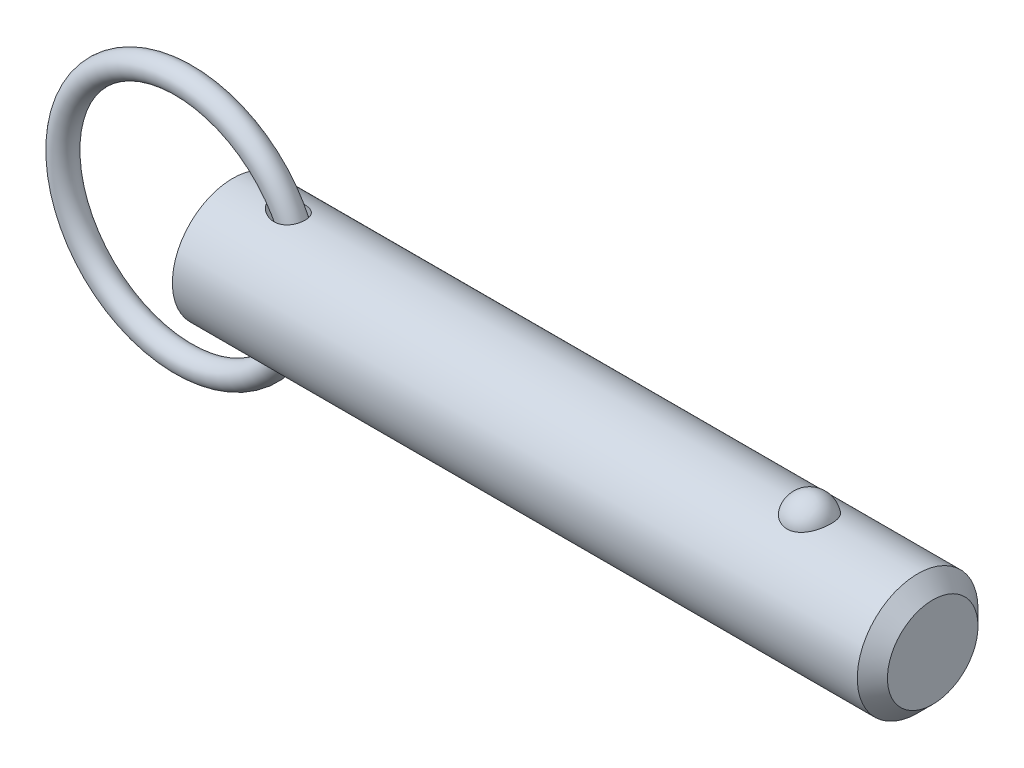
ISO-10303-21;
HEADER;
FILE_DESCRIPTION(('STEP AP214'),'2;1');
FILE_NAME('part.step','',(''),(''),'','','');
FILE_SCHEMA(('AUTOMOTIVE_DESIGN { 1 0 10303 214 1 1 1 1 }'));
ENDSEC;
DATA;
#1=APPLICATION_CONTEXT('core data for automotive mechanical design processes');
#2=APPLICATION_PROTOCOL_DEFINITION('international standard','automotive_design',2000,#1);
#3=PRODUCT_CONTEXT('',#1,'mechanical');
#4=PRODUCT('Part','Part','',(#3));
#5=PRODUCT_RELATED_PRODUCT_CATEGORY('part','',(#4));
#6=PRODUCT_DEFINITION_FORMATION('','',#4);
#7=PRODUCT_DEFINITION_CONTEXT('part definition',#1,'design');
#8=PRODUCT_DEFINITION('design','',#6,#7);
#9=PRODUCT_DEFINITION_SHAPE('','',#8);
#10=(LENGTH_UNIT() NAMED_UNIT(*) SI_UNIT(.MILLI.,.METRE.));
#11=(NAMED_UNIT(*) PLANE_ANGLE_UNIT() SI_UNIT($,.RADIAN.));
#12=(NAMED_UNIT(*) SI_UNIT($,.STERADIAN.) SOLID_ANGLE_UNIT());
#13=UNCERTAINTY_MEASURE_WITH_UNIT(LENGTH_MEASURE(1.E-05),#10,'distance_accuracy_value','');
#14=(GEOMETRIC_REPRESENTATION_CONTEXT(3) GLOBAL_UNCERTAINTY_ASSIGNED_CONTEXT((#13)) GLOBAL_UNIT_ASSIGNED_CONTEXT((#10,
#11,#12)) REPRESENTATION_CONTEXT('',''));
#15=CARTESIAN_POINT('',(0.,0.,0.));
#16=DIRECTION('',(0.,0.,1.));
#17=DIRECTION('',(1.,0.,0.));
#18=AXIS2_PLACEMENT_3D('',#15,#16,#17);
#19=CARTESIAN_POINT('',(-6.46799987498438,0.,0.));
#20=DIRECTION('',(0.,0.,1.));
#21=DIRECTION('',(1.,0.,0.));
#22=AXIS2_PLACEMENT_3D('',#19,#20,#21);
#23=TOROIDAL_SURFACE('',#22,15.875,1.588);
#24=CARTESIAN_POINT('',(10.9950001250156,0.,0.));
#25=VERTEX_POINT('',#24);
#26=VERTEX_LOOP('',#25);
#27=FACE_BOUND('',#26,.T.);
#28=ADVANCED_FACE('P0_F12',(#27),#23,.T.);
#29=CLOSED_SHELL('',(#28));
#30=MANIFOLD_SOLID_BREP('P0_B1',#29);
#31=CARTESIAN_POINT('',(0.,0.,0.));
#32=DIRECTION('',(1.,0.,0.));
#33=DIRECTION('',(0.,0.,-1.));
#34=AXIS2_PLACEMENT_3D('',#31,#32,#33);
#35=CYLINDRICAL_SURFACE('',#34,7.94);
#36=CARTESIAN_POINT('',(5.37881269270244,7.8641200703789,-1.0950869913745));
#37=CARTESIAN_POINT('',(5.49078530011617,7.84653010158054,-1.22142628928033));
#38=CARTESIAN_POINT('',(5.61742164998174,7.82766483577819,-1.33478448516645));
#39=CARTESIAN_POINT('',(5.82155225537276,7.80005811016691,-1.48501770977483));
#40=CARTESIAN_POINT('',(5.89211597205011,7.79095331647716,-1.53186949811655));
#41=CARTESIAN_POINT('',(6.03726296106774,7.77331484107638,-1.61899652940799));
#42=CARTESIAN_POINT('',(6.11184478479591,7.76478095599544,-1.65927412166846));
#43=CARTESIAN_POINT('',(6.31831542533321,7.74290334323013,-1.75933205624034));
#44=CARTESIAN_POINT('',(6.45343253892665,7.73042593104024,-1.81276183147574));
#45=CARTESIAN_POINT('',(6.73017339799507,7.70966096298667,-1.89912673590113));
#46=CARTESIAN_POINT('',(6.87179099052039,7.70136953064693,-1.93208083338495));
#47=CARTESIAN_POINT('',(7.17522096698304,7.6896684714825,-1.97820987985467));
#48=CARTESIAN_POINT('',(7.33750100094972,7.68691980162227,-1.98871513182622));
#49=CARTESIAN_POINT('',(7.5799424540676,7.68880305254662,-1.98137951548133));
#50=CARTESIAN_POINT('',(7.66059155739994,7.69043175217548,-1.97508575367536));
#51=CARTESIAN_POINT('',(7.82077465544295,7.69570110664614,-1.95445819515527));
#52=CARTESIAN_POINT('',(7.90030910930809,7.69934090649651,-1.94012781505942));
#53=CARTESIAN_POINT('',(8.09280087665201,7.71066069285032,-1.89475688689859));
#54=CARTESIAN_POINT('',(8.20465204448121,7.71942251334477,-1.85909462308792));
#55=CARTESIAN_POINT('',(8.42059371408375,7.74035594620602,-1.7699066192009));
#56=CARTESIAN_POINT('',(8.52468939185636,7.75252525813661,-1.71639292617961));
#57=CARTESIAN_POINT('',(8.72211003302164,7.77903750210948,-1.59192358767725));
#58=CARTESIAN_POINT('',(8.81539818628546,7.79338749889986,-1.52091076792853));
#59=CARTESIAN_POINT('',(8.98759177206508,7.8225086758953,-1.36321590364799));
#60=CARTESIAN_POINT('',(9.06649712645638,7.83727985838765,-1.27653377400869));
#61=CARTESIAN_POINT('',(9.20311499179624,7.86453692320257,-1.09567667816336));
#62=CARTESIAN_POINT('',(9.26180839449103,7.8771064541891,-1.00225329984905));
#63=CARTESIAN_POINT('',(9.36257622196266,7.89954213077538,-0.806547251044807));
#64=CARTESIAN_POINT('',(9.40465301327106,7.9094086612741,-0.70426584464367));
#65=CARTESIAN_POINT('',(9.47062404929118,7.92520709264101,-0.495461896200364));
#66=CARTESIAN_POINT('',(9.49478817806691,7.9311972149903,-0.389028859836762));
#67=CARTESIAN_POINT('',(9.52544004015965,7.93883641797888,-0.173494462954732));
#68=CARTESIAN_POINT('',(9.53192786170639,7.94048552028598,-0.0643931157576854));
#69=CARTESIAN_POINT('',(9.52707996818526,7.93926454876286,0.153487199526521));
#70=CARTESIAN_POINT('',(9.51572796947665,7.93639034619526,0.262265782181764));
#71=CARTESIAN_POINT('',(9.47542322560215,7.92642470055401,0.476313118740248));
#72=CARTESIAN_POINT('',(9.44647056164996,7.91933327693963,0.581581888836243));
#73=CARTESIAN_POINT('',(9.3716401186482,7.90170355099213,0.78560269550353));
#74=CARTESIAN_POINT('',(9.32576415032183,7.89116561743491,0.884355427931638));
#75=CARTESIAN_POINT('',(9.21823065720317,7.8677977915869,1.07254831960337));
#76=CARTESIAN_POINT('',(9.15657431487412,7.85496807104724,1.16198917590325));
#77=CARTESIAN_POINT('',(9.01919194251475,7.82843688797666,1.32903649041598));
#78=CARTESIAN_POINT('',(8.94347744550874,7.81473614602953,1.40665255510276));
#79=CARTESIAN_POINT('',(8.78012086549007,7.7879321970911,1.54819779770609));
#80=CARTESIAN_POINT('',(8.69247914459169,7.77482897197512,1.61212739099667));
#81=CARTESIAN_POINT('',(8.50642314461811,7.75037063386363,1.72592270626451));
#82=CARTESIAN_POINT('',(8.40786430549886,7.73904540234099,1.77555777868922));
#83=CARTESIAN_POINT('',(8.2039870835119,7.71943979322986,1.85894844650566));
#84=CARTESIAN_POINT('',(8.0986670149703,7.7111601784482,1.89270006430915));
#85=CARTESIAN_POINT('',(7.87703213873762,7.69782475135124,1.94625652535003));
#86=CARTESIAN_POINT('',(7.76044899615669,7.69301557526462,1.96500324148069));
#87=CARTESIAN_POINT('',(7.52574256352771,7.68770484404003,1.98567257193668));
#88=CARTESIAN_POINT('',(7.40761868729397,7.68720497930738,1.98758858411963));
#89=CARTESIAN_POINT('',(7.15639592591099,7.69044495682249,1.97502233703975));
#90=CARTESIAN_POINT('',(7.02341871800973,7.69476380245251,1.9583009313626));
#91=CARTESIAN_POINT('',(6.7612589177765,7.70776394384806,1.90648094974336));
#92=CARTESIAN_POINT('',(6.6320804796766,7.71644984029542,1.87136299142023));
#93=CARTESIAN_POINT('',(6.35978215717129,7.73875442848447,1.7770773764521));
#94=CARTESIAN_POINT('',(6.2177212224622,7.75293863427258,1.71496895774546));
#95=CARTESIAN_POINT('',(5.94559201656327,7.78383102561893,1.56880760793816));
#96=CARTESIAN_POINT('',(5.81552062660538,7.80053855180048,1.48476040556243));
#97=CARTESIAN_POINT('',(5.60081087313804,7.83035955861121,1.31701356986));
#98=CARTESIAN_POINT('',(5.51265224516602,7.84340226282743,1.23780647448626));
#99=CARTESIAN_POINT('',(5.34976240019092,7.86852524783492,1.06647953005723));
#100=CARTESIAN_POINT('',(5.27500719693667,7.88060722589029,0.974383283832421));
#101=CARTESIAN_POINT('',(5.15877594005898,7.89990441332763,0.80054830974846));
#102=CARTESIAN_POINT('',(5.11360209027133,7.90759876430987,0.72134812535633));
#103=CARTESIAN_POINT('',(5.03655060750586,7.92090267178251,0.556518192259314));
#104=CARTESIAN_POINT('',(5.00466157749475,7.92651401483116,0.47089402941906));
#105=CARTESIAN_POINT('',(4.95653766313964,7.93503671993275,0.294356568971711));
#106=CARTESIAN_POINT('',(4.94043621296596,7.93792505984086,0.203404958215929));
#107=CARTESIAN_POINT('',(4.92605720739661,7.94050250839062,0.0200631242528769));
#108=CARTESIAN_POINT('',(4.92776929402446,7.9401934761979,-0.072326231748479));
#109=CARTESIAN_POINT('',(4.94742735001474,7.93667454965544,-0.243250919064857));
#110=CARTESIAN_POINT('',(4.96327131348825,7.93384031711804,-0.322048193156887));
#111=CARTESIAN_POINT('',(5.00707570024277,7.92609115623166,-0.476058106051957));
#112=CARTESIAN_POINT('',(5.03503965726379,7.92117562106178,-0.551269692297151));
#113=CARTESIAN_POINT('',(5.10737112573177,7.90866290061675,-0.709995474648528));
#114=CARTESIAN_POINT('',(5.15379379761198,7.90074105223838,-0.792541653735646));
#115=CARTESIAN_POINT('',(5.25820836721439,7.88338732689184,-0.949781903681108));
#116=CARTESIAN_POINT('',(5.31621941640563,7.87395295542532,-1.02446265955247));
#117=CARTESIAN_POINT('',(5.37881269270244,7.8641200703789,-1.0950869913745));
#118=B_SPLINE_CURVE_WITH_KNOTS('',3,(#36,#37,#38,#39,#40,#41,#42,#43,#44,#45,#46,#47,#48,#49,
#50,#51,#52,#53,#54,#55,#56,#57,#58,#59,#60,#61,#62,#63,#64,#65,#66,#67,#68,#69,#70,#71,#72,#73,
#74,#75,#76,#77,#78,#79,#80,#81,#82,#83,#84,#85,#86,#87,#88,#89,#90,#91,#92,#93,#94,#95,#96,#97,
#98,#99,#100,#101,#102,#103,#104,#105,#106,#107,#108,#109,#110,#111,#112,#113,#114,#115,#116,
#117),.UNSPECIFIED.,.T.,.F.,(4,2,2,2,2,2,2,2,2,2,2,2,2,2,2,2,2,2,2,2,2,2,2,2,2,2,2,2,2,2,2,2,2,
2,2,2,2,2,2,2,4),(0.,0.508599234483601,0.763935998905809,1.01918131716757,1.45492798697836,
1.89027038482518,2.37502798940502,2.61739702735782,2.8596631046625,3.21120678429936,
3.56251370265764,3.91498401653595,4.26745624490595,4.59897839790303,4.93045331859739,
5.25682643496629,5.58319792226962,5.909867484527,6.23653553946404,6.56316865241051,
6.88977729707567,7.21611917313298,7.54245114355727,7.87378632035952,8.20520442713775,
8.55832700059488,8.91158808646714,9.31234018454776,9.71351536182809,10.1786231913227,
10.6436096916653,11.0001264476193,11.3559986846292,11.6294791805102,11.9027245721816,
12.1782599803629,12.4536351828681,12.693828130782,12.9340911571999,13.2179277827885,
13.5022374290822),.UNSPECIFIED.);
#119=CARTESIAN_POINT('',(5.37881269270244,7.8641200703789,-1.0950869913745));
#120=VERTEX_POINT('',#119);
#121=EDGE_CURVE('P1_E40',#120,#120,#118,.T.);
#122=ORIENTED_EDGE('',*,*,#121,.T.);
#123=EDGE_LOOP('',(#122));
#124=FACE_BOUND('',#123,.T.);
#125=CARTESIAN_POINT('',(90.095,0.,0.));
#126=DIRECTION('',(1.,0.,0.));
#127=DIRECTION('',(0.,0.,-1.));
#128=AXIS2_PLACEMENT_3D('',#125,#126,#127);
#129=CIRCLE('',#128,7.94);
#130=CARTESIAN_POINT('',(90.095,0.,-7.94));
#131=VERTEX_POINT('',#130);
#132=EDGE_CURVE('P1_E25',#131,#131,#129,.T.);
#133=ORIENTED_EDGE('',*,*,#132,.F.);
#134=EDGE_LOOP('',(#133));
#135=FACE_BOUND('',#134,.T.);
#136=CARTESIAN_POINT('',(0.,0.,0.));
#137=DIRECTION('',(1.,0.,0.));
#138=DIRECTION('',(0.,0.,-1.));
#139=AXIS2_PLACEMENT_3D('',#136,#137,#138);
#140=CIRCLE('',#139,7.94);
#141=CARTESIAN_POINT('',(0.,0.,-7.94));
#142=VERTEX_POINT('',#141);
#143=EDGE_CURVE('P1_E9',#142,#142,#140,.T.);
#144=ORIENTED_EDGE('',*,*,#143,.T.);
#145=EDGE_LOOP('',(#144));
#146=FACE_BOUND('',#145,.T.);
#147=CARTESIAN_POINT('',(75.8649074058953,7.37767842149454,2.93486986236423));
#148=CARTESIAN_POINT('',(75.7127496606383,7.3776732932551,2.93487505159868));
#149=CARTESIAN_POINT('',(75.5606329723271,7.38258419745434,2.92262454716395));
#150=CARTESIAN_POINT('',(75.2609284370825,7.40163229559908,2.87404196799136));
#151=CARTESIAN_POINT('',(75.1133394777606,7.41576720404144,2.83771585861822));
#152=CARTESIAN_POINT('',(74.8270187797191,7.4516157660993,2.74218769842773));
#153=CARTESIAN_POINT('',(74.6882745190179,7.47331841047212,2.68301886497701));
#154=CARTESIAN_POINT('',(74.4228822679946,7.52194082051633,2.54350967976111));
#155=CARTESIAN_POINT('',(74.2962366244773,7.5488615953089,2.46316523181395));
#156=CARTESIAN_POINT('',(74.0545349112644,7.60594671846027,2.28090375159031));
#157=CARTESIAN_POINT('',(73.9399065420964,7.63618114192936,2.17844211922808));
#158=CARTESIAN_POINT('',(73.7288787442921,7.69614046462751,1.95608495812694));
#159=CARTESIAN_POINT('',(73.6324826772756,7.72586526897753,1.83618622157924));
#160=CARTESIAN_POINT('',(73.4559381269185,7.78314821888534,1.57628086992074));
#161=CARTESIAN_POINT('',(73.3767072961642,7.81055035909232,1.43561546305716));
#162=CARTESIAN_POINT('',(73.2417979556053,7.85879631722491,1.14236334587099));
#163=CARTESIAN_POINT('',(73.1861216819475,7.87963951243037,0.98977550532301));
#164=CARTESIAN_POINT('',(73.0988121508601,7.91289645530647,0.674619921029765));
#165=CARTESIAN_POINT('',(73.0675309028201,7.925186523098,0.511941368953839));
#166=CARTESIAN_POINT('',(73.030975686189,7.93958930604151,0.183247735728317));
#167=CARTESIAN_POINT('',(73.0257012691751,7.94170219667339,0.0172327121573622));
#168=CARTESIAN_POINT('',(73.0412311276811,7.93554931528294,-0.312672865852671));
#169=CARTESIAN_POINT('',(73.0619253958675,7.92732732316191,-0.4765694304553));
#170=CARTESIAN_POINT('',(73.1287865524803,7.90141534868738,-0.798305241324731));
#171=CARTESIAN_POINT('',(73.1749539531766,7.88372517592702,-0.956144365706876));
#172=CARTESIAN_POINT('',(73.2918986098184,7.84066230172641,-1.26152073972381));
#173=CARTESIAN_POINT('',(73.3627046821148,7.81528060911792,-1.40904568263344));
#174=CARTESIAN_POINT('',(73.5274789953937,7.7594867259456,-1.68950598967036));
#175=CARTESIAN_POINT('',(73.6214488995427,7.72907417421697,-1.82244030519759));
#176=CARTESIAN_POINT('',(73.8308391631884,7.66640424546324,-2.07032792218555));
#177=CARTESIAN_POINT('',(73.9463152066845,7.63414223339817,-2.1852330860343));
#178=CARTESIAN_POINT('',(74.1959006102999,7.57149681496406,-2.39329737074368));
#179=CARTESIAN_POINT('',(74.3300080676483,7.54111321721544,-2.48645870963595));
#180=CARTESIAN_POINT('',(74.6101113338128,7.48650742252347,-2.64628132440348));
#181=CARTESIAN_POINT('',(74.7557605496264,7.46215900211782,-2.71350554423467));
#182=CARTESIAN_POINT('',(75.0574259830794,7.42171253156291,-2.82226614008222));
#183=CARTESIAN_POINT('',(75.2134383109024,7.40561140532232,-2.86381209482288));
#184=CARTESIAN_POINT('',(75.5229708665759,7.3842679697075,-2.91839077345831));
#185=CARTESIAN_POINT('',(75.6762229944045,7.37852109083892,-2.93275024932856));
#186=CARTESIAN_POINT('',(75.9830705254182,7.37700973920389,-2.93655208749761));
#187=CARTESIAN_POINT('',(76.1366658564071,7.38124333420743,-2.92599927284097));
#188=CARTESIAN_POINT('',(76.4349907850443,7.39890635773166,-2.88102897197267));
#189=CARTESIAN_POINT('',(76.5798480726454,7.41205491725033,-2.8473399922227));
#190=CARTESIAN_POINT('',(76.8616432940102,7.445801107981,-2.75788206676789));
#191=CARTESIAN_POINT('',(76.9985805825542,7.46639934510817,-2.70211132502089));
#192=CARTESIAN_POINT('',(77.2640619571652,7.51339098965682,-2.56858908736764));
#193=CARTESIAN_POINT('',(77.3923548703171,7.53990200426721,-2.49038067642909));
#194=CARTESIAN_POINT('',(77.6342440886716,7.59569503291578,-2.31462737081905));
#195=CARTESIAN_POINT('',(77.7478370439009,7.62497767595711,-2.21707808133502));
#196=CARTESIAN_POINT('',(77.96322156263,7.68489473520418,-1.99982049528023));
#197=CARTESIAN_POINT('',(78.0641488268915,7.71552419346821,-1.87925337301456));
#198=CARTESIAN_POINT('',(78.2451866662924,7.77353016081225,-1.62268826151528));
#199=CARTESIAN_POINT('',(78.3252934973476,7.80090608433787,-1.4866875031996));
#200=CARTESIAN_POINT('',(78.4653615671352,7.85047992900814,-1.19818413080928));
#201=CARTESIAN_POINT('',(78.5245877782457,7.8724818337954,-1.04529016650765));
#202=CARTESIAN_POINT('',(78.6179821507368,7.90785114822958,-0.731080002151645));
#203=CARTESIAN_POINT('',(78.6521497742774,7.92121837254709,-0.569763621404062));
#204=CARTESIAN_POINT('',(78.694795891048,7.93797834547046,-0.242812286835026));
#205=CARTESIAN_POINT('',(78.7032047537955,7.94134405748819,-0.0771668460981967));
#206=CARTESIAN_POINT('',(78.6939626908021,7.93767937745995,0.253276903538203));
#207=CARTESIAN_POINT('',(78.6763120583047,7.93064910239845,0.418075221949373));
#208=CARTESIAN_POINT('',(78.615424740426,7.90695571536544,0.741525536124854));
#209=CARTESIAN_POINT('',(78.5722819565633,7.8903279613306,0.900197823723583));
#210=CARTESIAN_POINT('',(78.4613535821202,7.84916386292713,1.20759654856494));
#211=CARTESIAN_POINT('',(78.39356656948,7.82462706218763,1.35632241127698));
#212=CARTESIAN_POINT('',(78.2343718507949,7.7700669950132,1.64032869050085));
#213=CARTESIAN_POINT('',(78.1428616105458,7.7400200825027,1.77554712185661));
#214=CARTESIAN_POINT('',(77.9382960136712,7.67774175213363,2.02800648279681));
#215=CARTESIAN_POINT('',(77.8252410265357,7.64551037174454,2.14524772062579));
#216=CARTESIAN_POINT('',(77.5808318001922,7.58265895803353,2.35778002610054));
#217=CARTESIAN_POINT('',(77.4495833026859,7.55203092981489,2.45319004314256));
#218=CARTESIAN_POINT('',(77.171601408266,7.49579792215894,2.61999897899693));
#219=CARTESIAN_POINT('',(77.0248670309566,7.47019326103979,2.69139637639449));
#220=CARTESIAN_POINT('',(76.7129477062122,7.42622216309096,2.8105324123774));
#221=CARTESIAN_POINT('',(76.5472209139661,7.40825002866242,2.85700910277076));
#222=CARTESIAN_POINT('',(76.2092792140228,7.38398348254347,2.9191685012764));
#223=CARTESIAN_POINT('',(76.0370670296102,7.3776842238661,2.93486399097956));
#224=CARTESIAN_POINT('',(75.8649074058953,7.37767842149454,2.93486986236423));
#225=B_SPLINE_CURVE_WITH_KNOTS('',3,(#147,#148,#149,#150,#151,#152,#153,#154,#155,#156,#157,
#158,#159,#160,#161,#162,#163,#164,#165,#166,#167,#168,#169,#170,#171,#172,#173,#174,#175,#176,
#177,#178,#179,#180,#181,#182,#183,#184,#185,#186,#187,#188,#189,#190,#191,#192,#193,#194,#195,
#196,#197,#198,#199,#200,#201,#202,#203,#204,#205,#206,#207,#208,#209,#210,#211,#212,#213,#214,
#215,#216,#217,#218,#219,#220,#221,#222,#223,#224),.UNSPECIFIED.,.T.,.F.,(4,2,2,2,2,2,2,2,2,2,2,
2,2,2,2,2,2,2,2,2,2,2,2,2,2,2,2,2,2,2,2,2,2,2,2,2,2,2,4),(0.,0.45584132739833,0.911569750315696,
1.36663794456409,1.8217942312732,2.28978983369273,2.7578716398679,3.246853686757,
3.73588214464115,4.23184282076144,4.72779494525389,5.22165321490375,5.71552141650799,
6.20996917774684,6.70445245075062,7.20023431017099,7.69596557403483,8.18023418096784,
8.66432203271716,9.12410697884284,9.58380291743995,10.0296503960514,10.4755341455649,
10.9312349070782,11.3870393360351,11.8654416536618,12.3439299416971,12.8378875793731,
13.3318558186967,13.8271581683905,14.3224549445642,14.8159385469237,15.3094506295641,
15.8051323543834,16.3008055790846,16.7937101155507,17.2866458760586,17.8026240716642,
18.3183879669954),.UNSPECIFIED.);
#226=CARTESIAN_POINT('',(75.8649074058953,7.37767842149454,2.93486986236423));
#227=VERTEX_POINT('',#226);
#228=EDGE_CURVE('P1_E34',#227,#227,#225,.T.);
#229=ORIENTED_EDGE('',*,*,#228,.T.);
#230=EDGE_LOOP('',(#229));
#231=FACE_BOUND('',#230,.T.);
#232=CARTESIAN_POINT('',(5.37881269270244,-7.8641200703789,-1.0950869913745));
#233=CARTESIAN_POINT('',(5.31532711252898,-7.87409326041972,-1.02345575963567));
#234=CARTESIAN_POINT('',(5.25654962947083,-7.88365715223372,-0.947641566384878));
#235=CARTESIAN_POINT('',(5.15093536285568,-7.90122221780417,-0.787865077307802));
#236=CARTESIAN_POINT('',(5.10408931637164,-7.90922460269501,-0.703909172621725));
#237=CARTESIAN_POINT('',(5.02499142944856,-7.92292057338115,-0.527991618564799));
#238=CARTESIAN_POINT('',(4.99290048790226,-7.92858863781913,-0.435954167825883));
#239=CARTESIAN_POINT('',(4.94718343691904,-7.93670712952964,-0.247266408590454));
#240=CARTESIAN_POINT('',(4.93353142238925,-7.93916207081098,-0.150622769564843));
#241=CARTESIAN_POINT('',(4.92669426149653,-7.94038957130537,0.0306459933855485));
#242=CARTESIAN_POINT('',(4.93105622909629,-7.93960347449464,0.115182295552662));
#243=CARTESIAN_POINT('',(4.95441758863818,-7.93542535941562,0.282133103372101));
#244=CARTESIAN_POINT('',(4.97342060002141,-7.93203269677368,0.364547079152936));
#245=CARTESIAN_POINT('',(5.02337664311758,-7.92322764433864,0.521528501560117));
#246=CARTESIAN_POINT('',(5.05377582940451,-7.91790920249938,0.596281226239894));
#247=CARTESIAN_POINT('',(5.1246872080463,-7.90571364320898,0.740640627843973));
#248=CARTESIAN_POINT('',(5.16520358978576,-7.89883588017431,0.810245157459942));
#249=CARTESIAN_POINT('',(5.27792634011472,-7.88012470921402,0.978620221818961));
#250=CARTESIAN_POINT('',(5.35563200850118,-7.86757912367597,1.07363778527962));
#251=CARTESIAN_POINT('',(5.52523836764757,-7.84150676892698,1.24994147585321));
#252=CARTESIAN_POINT('',(5.61717506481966,-7.82797755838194,1.33119164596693));
#253=CARTESIAN_POINT('',(5.83913717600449,-7.79742756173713,1.50104748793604));
#254=CARTESIAN_POINT('',(5.97257429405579,-7.78050347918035,1.58521567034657));
#255=CARTESIAN_POINT('',(6.25160600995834,-7.74942135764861,1.73078109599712));
#256=CARTESIAN_POINT('',(6.39720857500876,-7.73526515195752,1.79216327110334));
#257=CARTESIAN_POINT('',(6.69793322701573,-7.7116170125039,1.89134478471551));
#258=CARTESIAN_POINT('',(6.85312134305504,-7.70216275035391,1.92895428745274));
#259=CARTESIAN_POINT('',(7.16781951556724,-7.68988337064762,1.97736316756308));
#260=CARTESIAN_POINT('',(7.32732244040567,-7.68704791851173,1.98820434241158));
#261=CARTESIAN_POINT('',(7.61290770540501,-7.68890797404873,1.98097687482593));
#262=CARTESIAN_POINT('',(7.73913797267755,-7.69217875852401,1.96837928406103));
#263=CARTESIAN_POINT('',(7.98774248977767,-7.70364253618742,1.92303262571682));
#264=CARTESIAN_POINT('',(8.11011880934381,-7.71183283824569,1.89029457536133));
#265=CARTESIAN_POINT('',(8.34766306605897,-7.73253074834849,1.80375920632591));
#266=CARTESIAN_POINT('',(8.46278682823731,-7.74506226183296,1.74984505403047));
#267=CARTESIAN_POINT('',(8.68062682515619,-7.77294147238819,1.62149891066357));
#268=CARTESIAN_POINT('',(8.78334736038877,-7.78828818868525,1.54707406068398));
#269=CARTESIAN_POINT('',(8.9627595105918,-7.81808719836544,1.38814746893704));
#270=CARTESIAN_POINT('',(9.04102925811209,-7.83247448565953,1.30540890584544));
#271=CARTESIAN_POINT('',(9.18176824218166,-7.86008608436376,1.12727331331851));
#272=CARTESIAN_POINT('',(9.24424163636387,-7.87331070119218,1.03187962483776));
#273=CARTESIAN_POINT('',(9.34924815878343,-7.89649032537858,0.835684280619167));
#274=CARTESIAN_POINT('',(9.39252490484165,-7.90656172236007,0.735293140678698));
#275=CARTESIAN_POINT('',(9.46188913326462,-7.92307290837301,0.528458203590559));
#276=CARTESIAN_POINT('',(9.48797767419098,-7.92951292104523,0.422014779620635));
#277=CARTESIAN_POINT('',(9.5222867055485,-7.93804067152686,0.206589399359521));
#278=CARTESIAN_POINT('',(9.53058328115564,-7.94014694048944,0.0976202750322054));
#279=CARTESIAN_POINT('',(9.52935292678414,-7.93983698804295,-0.120212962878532));
#280=CARTESIAN_POINT('',(9.51982577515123,-7.93742071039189,-0.229077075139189));
#281=CARTESIAN_POINT('',(9.48313466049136,-7.92831916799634,-0.443751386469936));
#282=CARTESIAN_POINT('',(9.45594838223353,-7.92162850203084,-0.549557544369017));
#283=CARTESIAN_POINT('',(9.38454658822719,-7.90469917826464,-0.754954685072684));
#284=CARTESIAN_POINT('',(9.34033171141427,-7.89446065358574,-0.854545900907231));
#285=CARTESIAN_POINT('',(9.23602927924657,-7.87157146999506,-1.04456732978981));
#286=CARTESIAN_POINT('',(9.17596171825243,-7.85892385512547,-1.13500888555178));
#287=CARTESIAN_POINT('',(9.0415343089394,-7.83259746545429,-1.30436780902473));
#288=CARTESIAN_POINT('',(8.96717562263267,-7.81891877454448,-1.38328611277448));
#289=CARTESIAN_POINT('',(8.80603455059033,-7.79196869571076,-1.52782923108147));
#290=CARTESIAN_POINT('',(8.71921490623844,-7.77869867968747,-1.59341269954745));
#291=CARTESIAN_POINT('',(8.53589430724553,-7.7539823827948,-1.7096493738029));
#292=CARTESIAN_POINT('',(8.439392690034,-7.74253622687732,-1.76030155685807));
#293=CARTESIAN_POINT('',(8.23614706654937,-7.72219212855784,-1.84754820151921));
#294=CARTESIAN_POINT('',(8.12916866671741,-7.71339202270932,-1.88361685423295));
#295=CARTESIAN_POINT('',(7.91082287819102,-7.69955300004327,-1.93940887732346));
#296=CARTESIAN_POINT('',(7.79945379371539,-7.69451555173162,-1.95912586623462));
#297=CARTESIAN_POINT('',(7.56409927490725,-7.6881073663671,-1.98413612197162));
#298=CARTESIAN_POINT('',(7.43993744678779,-7.68713944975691,-1.98784574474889));
#299=CARTESIAN_POINT('',(7.19239878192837,-7.68969629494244,-1.97792309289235));
#300=CARTESIAN_POINT('',(7.0690222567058,-7.69322274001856,-1.96428432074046));
#301=CARTESIAN_POINT('',(6.80624991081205,-7.70498367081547,-1.91768089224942));
#302=CARTESIAN_POINT('',(6.667361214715,-7.71386737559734,-1.88203087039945));
#303=CARTESIAN_POINT('',(6.39625444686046,-7.73551250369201,-1.79098714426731));
#304=CARTESIAN_POINT('',(6.26404857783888,-7.74828074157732,-1.73555871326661));
#305=CARTESIAN_POINT('',(6.06559048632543,-7.77003865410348,-1.63446133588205));
#306=CARTESIAN_POINT('',(5.99591479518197,-7.77821880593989,-1.59522999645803));
#307=CARTESIAN_POINT('',(5.86025875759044,-7.79503524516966,-1.51091846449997));
#308=CARTESIAN_POINT('',(5.79427944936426,-7.8036716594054,-1.46583664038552));
#309=CARTESIAN_POINT('',(5.60322733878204,-7.82978128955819,-1.3219827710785));
#310=CARTESIAN_POINT('',(5.4844964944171,-7.84751780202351,-1.21433077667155));
#311=CARTESIAN_POINT('',(5.37881269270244,-7.8641200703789,-1.0950869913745));
#312=B_SPLINE_CURVE_WITH_KNOTS('',3,(#232,#233,#234,#235,#236,#237,#238,#239,#240,#241,#242,
#243,#244,#245,#246,#247,#248,#249,#250,#251,#252,#253,#254,#255,#256,#257,#258,#259,#260,#261,
#262,#263,#264,#265,#266,#267,#268,#269,#270,#271,#272,#273,#274,#275,#276,#277,#278,#279,#280,
#281,#282,#283,#284,#285,#286,#287,#288,#289,#290,#291,#292,#293,#294,#295,#296,#297,#298,#299,
#300,#301,#302,#303,#304,#305,#306,#307,#308,#309,#310,#311),.UNSPECIFIED.,.T.,.F.,(4,2,2,2,2,2,
2,2,2,2,2,2,2,2,2,2,2,2,2,2,2,2,2,2,2,2,2,2,2,2,2,2,2,2,2,2,2,2,2,4),(0.,0.288363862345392,
0.576503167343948,0.867714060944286,1.15851540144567,1.41111828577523,1.66378363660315,
1.90549406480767,2.14730474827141,2.51540453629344,2.88445136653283,3.35805159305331,
3.83196445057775,4.30961543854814,4.78652012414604,5.16565662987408,5.54458592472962,
5.92563591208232,6.30655339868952,6.64920782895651,6.99177197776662,7.31956587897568,
7.64733959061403,7.97370879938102,8.30008206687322,8.62686856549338,8.95364280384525,
9.28000684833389,9.60634436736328,9.93367879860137,10.261035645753,10.59932199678,
10.9377403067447,11.308967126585,11.6803330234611,12.1096921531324,12.5398088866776,
12.7806650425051,13.0215885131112,13.5016249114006),.UNSPECIFIED.);
#313=CARTESIAN_POINT('',(5.37881269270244,-7.8641200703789,-1.0950869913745));
#314=VERTEX_POINT('',#313);
#315=EDGE_CURVE('P1_E17',#314,#314,#312,.T.);
#316=ORIENTED_EDGE('',*,*,#315,.T.);
#317=EDGE_LOOP('',(#316));
#318=FACE_BOUND('',#317,.T.);
#319=ADVANCED_FACE('P1_F13',(#124,#135,#146,#231,#318),#35,.T.);
#320=CARTESIAN_POINT('',(0.,0.,0.));
#321=DIRECTION('',(-1.,0.,0.));
#322=DIRECTION('',(0.,0.,1.));
#323=AXIS2_PLACEMENT_3D('',#320,#321,#322);
#324=PLANE('',#323);
#325=ORIENTED_EDGE('',*,*,#143,.F.);
#326=EDGE_LOOP('',(#325));
#327=FACE_BOUND('',#326,.T.);
#328=ADVANCED_FACE('P1_F15',(#327),#324,.T.);
#329=CARTESIAN_POINT('',(92.08,0.,0.));
#330=DIRECTION('',(-1.,0.,0.));
#331=DIRECTION('',(0.,0.,1.));
#332=AXIS2_PLACEMENT_3D('',#329,#330,#331);
#333=CONICAL_SURFACE('',#332,5.95500000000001,0.785398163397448);
#334=ORIENTED_EDGE('',*,*,#132,.T.);
#335=EDGE_LOOP('',(#334));
#336=FACE_BOUND('',#335,.T.);
#337=CARTESIAN_POINT('',(92.08,0.,0.));
#338=DIRECTION('',(1.,0.,0.));
#339=DIRECTION('',(0.,0.,-1.));
#340=AXIS2_PLACEMENT_3D('',#337,#338,#339);
#341=CIRCLE('',#340,5.95500000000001);
#342=CARTESIAN_POINT('',(92.08,0.,-5.95500000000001));
#343=VERTEX_POINT('',#342);
#344=EDGE_CURVE('P1_E30',#343,#343,#341,.T.);
#345=ORIENTED_EDGE('',*,*,#344,.F.);
#346=EDGE_LOOP('',(#345));
#347=FACE_BOUND('',#346,.T.);
#348=ADVANCED_FACE('P1_F55',(#336,#347),#333,.T.);
#349=CARTESIAN_POINT('',(92.08,5.95500000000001,0.));
#350=DIRECTION('',(1.,0.,0.));
#351=DIRECTION('',(0.,0.,-1.));
#352=AXIS2_PLACEMENT_3D('',#349,#350,#351);
#353=PLANE('',#352);
#354=ORIENTED_EDGE('',*,*,#344,.T.);
#355=EDGE_LOOP('',(#354));
#356=FACE_BOUND('',#355,.T.);
#357=ADVANCED_FACE('P1_F51',(#356),#353,.T.);
#358=CARTESIAN_POINT('',(75.8649074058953,7.146,0.));
#359=DIRECTION('',(-1.,0.,0.));
#360=DIRECTION('',(0.,1.,0.));
#361=AXIS2_PLACEMENT_3D('',#358,#359,#360);
#362=SPHERICAL_SURFACE('',#361,2.944);
#363=ORIENTED_EDGE('',*,*,#228,.F.);
#364=EDGE_LOOP('',(#363));
#365=FACE_BOUND('',#364,.T.);
#366=ADVANCED_FACE('P1_F46',(#365),#362,.T.);
#367=CARTESIAN_POINT('',(-6.46799987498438,0.,0.));
#368=DIRECTION('',(0.,0.,1.));
#369=DIRECTION('',(1.,0.,0.));
#370=AXIS2_PLACEMENT_3D('',#367,#368,#369);
#371=TOROIDAL_SURFACE('',#370,15.875,1.985);
#372=ORIENTED_EDGE('',*,*,#315,.F.);
#373=EDGE_LOOP('',(#372));
#374=FACE_BOUND('',#373,.T.);
#375=ORIENTED_EDGE('',*,*,#121,.F.);
#376=EDGE_LOOP('',(#375));
#377=FACE_BOUND('',#376,.T.);
#378=ADVANCED_FACE('P1_F50',(#374,#377),#371,.F.);
#379=CLOSED_SHELL('',(#319,#328,#348,#357,#366,#378));
#380=MANIFOLD_SOLID_BREP('P1_B1',#379);
#381=ADVANCED_BREP_SHAPE_REPRESENTATION('',(#18,#30,#380),#14);
#382=SHAPE_DEFINITION_REPRESENTATION(#9,#381);
ENDSEC;
END-ISO-10303-21;
